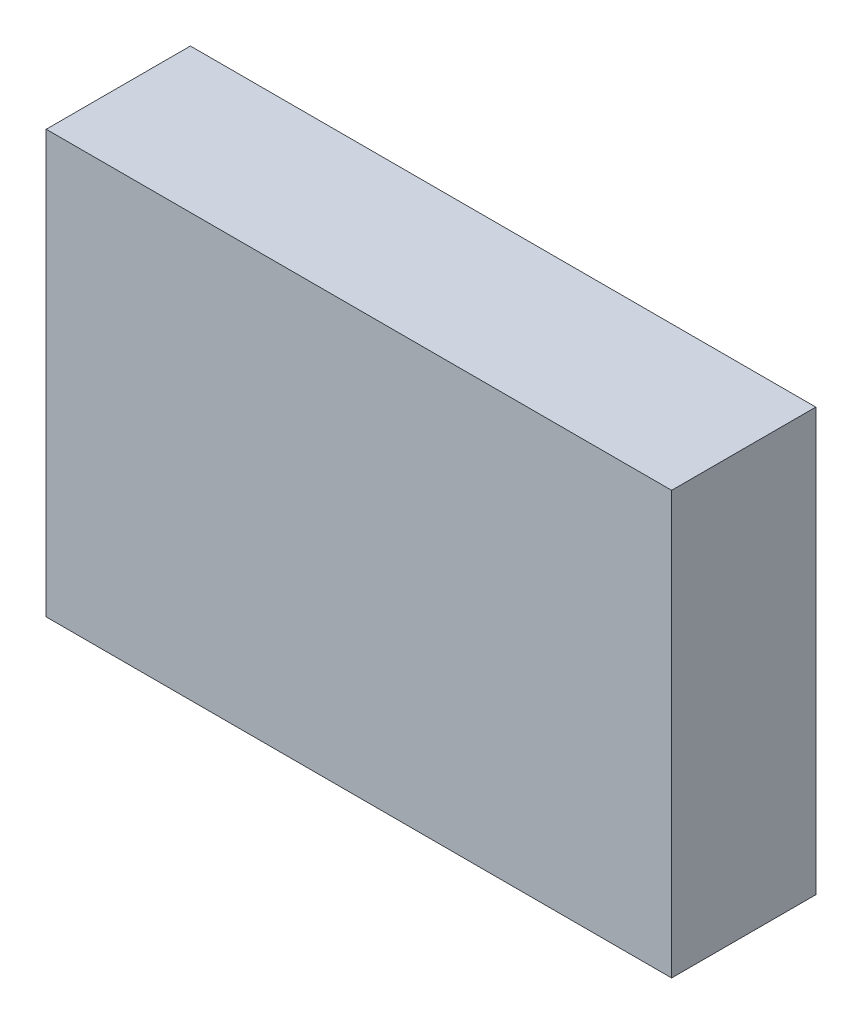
from build123d import *

# Parameters (mm, degrees)
SKICA1_W                                          = 150
SKICA1_H                                          = 100
VYSUNOUT1_DEPTH                                   = 30
ZKOSEN_2_SIZE                                     = 3
SKICA2_W                                          = 17.5
SKICA2_H                                          = 20
VYSUNOUT2_DEPTH                                   = 129.549601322
SKICA3_W                                          = 17.5
SKICA3_H                                          = 60
VYSUNOUT3_DEPTH                                   = 93.330926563
ZAOBLIT1_R                                        = 6
ZKOSEN_1_SIZE                                     = 3
V_LCOV_ZAHLOUBEN_PRO_M6_ROUBY_S_K_NIC_D           = 6.6
V_LCOV_ZAHLOUBEN_PRO_M6_ROUBY_S_K_NIC_CBORE_D     = 11
V_LCOV_ZAHLOUBEN_PRO_M6_ROUBY_S_K_NIC_CBORE_DEPTH = 3.9
ZKOSEN_4_SIZE                                     = 0.5
VYSUNOUT5_DEPTH                                   = 15
VYSUNOUT4_DEPTH                                   = 5
ZAOBLIT2_R                                        = 6
VYSUNOUT6_START                                   = -20
VYSUNOUT6_DEPTH                                   = 20
VYSUNOUT8_DEPTH                                   = 20
M4X0_7_Z_VIT1_D                                   = 3.3
M4X0_7_Z_VIT1_DEPTH                               = 11.5
M4X0_7_Z_VIT1_TIP                                 = 0.991420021
M4X0_7_Z_VIT1_ON_FACE_2_D                         = 3.3
M4X0_7_Z_VIT1_ON_FACE_2_DEPTH                     = 11.5
M4X0_7_Z_VIT1_ON_FACE_2_TIP                       = 0.991420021
VYSUNOUT9_DEPTH                                   = 94.541434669
ZAOBLIT5_R                                        = 3
VYSUNOUT11_REACH                                  = 123.514
SKICA15_R                                         = 5
VYSUNOUT12_DEPTH                                  = 3
F_5_0_5_PR_M_R_D_RY1_D                            = 5
F_5_0_5_PR_M_R_D_RY1_DEPTH                        = 10
F_5_0_5_PR_M_R_D_RY1_TIP                          = 1.502151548
ZKOSEN_3_SIZE                                     = 1
P_IDAT_VYSUNUT_M1_DEPTH                           = 30.5
P_IDAT_VYSUNUT_M1_DEPTH_BACK                      = 5
SKICA22_W                                         = 154
SKICA22_H                                         = 104


with BuildPart() as part:
    # Skica1 → Vysunout1 (new body)
    with BuildSketch(Plane.XY):
        Rectangle(SKICA1_W, SKICA1_H)
    extrude(amount=VYSUNOUT1_DEPTH)

    # Zkosen_2
    zkosen_2_edges = [part.edges().sort_by_distance(p)[0] for p in [
        (75, -50, 15),
        (-75, -50, 15),
        (-75, 50, 15),
        (75, 50, 15),
    ]]
    chamfer(zkosen_2_edges, length=ZKOSEN_2_SIZE)

    # Skica2 → Vysunout2 (cut, through all)
    with BuildSketch(Plane.XZ.offset(50)):
        with Locations((66.25, 20)):
            Rectangle(SKICA2_W, SKICA2_H)
        with Locations((-66.25, 20)):
            Rectangle(SKICA2_W, SKICA2_H)
    extrude(amount=-VYSUNOUT2_DEPTH, mode=Mode.SUBTRACT)

    # Skica3 → Vysunout3 (cut, through all)
    with BuildSketch(Plane.XY.offset(10)):
        with Locations((66.25, 0)):
            Rectangle(SKICA3_W, SKICA3_H)
        with Locations((-66.25, 0)):
            Rectangle(SKICA3_W, SKICA3_H)
    extrude(amount=-VYSUNOUT3_DEPTH, mode=Mode.SUBTRACT)

    # Zaoblit1
    zaoblit1_edges = [part.edges().sort_by_distance(p)[0] for p in [
        (-57.5, 30, 5),
        (-57.5, -30, 5),
        (57.5, -30, 5),
        (57.5, 30, 5),
    ]]
    fillet(zaoblit1_edges, radius=ZAOBLIT1_R)

    # Zkosen_1
    zkosen_1_edges = [part.edges().sort_by_distance(p)[0] for p in [
        (-75, 30, 5),
        (-75, -30, 5),
        (75, 30, 5),
        (75, -30, 5),
    ]]
    chamfer(zkosen_1_edges, length=ZKOSEN_1_SIZE)

    # V_lcov_ zahlouben_ pro M6 _rouby s k_nic (through all)
    with Locations(Plane.XY.offset(10)):
        with Locations((-66.25, 40), (-66.25, -40), (66.25, -40), (66.25, 40)):
            CounterBoreHole(V_LCOV_ZAHLOUBEN_PRO_M6_ROUBY_S_K_NIC_D / 2, V_LCOV_ZAHLOUBEN_PRO_M6_ROUBY_S_K_NIC_CBORE_D / 2, V_LCOV_ZAHLOUBEN_PRO_M6_ROUBY_S_K_NIC_CBORE_DEPTH)

    # Zkosen_4
    zkosen_4_edges = [part.edges().sort_by_distance(p)[0] for p in [
        (69.55, 40, 6.1),
        (69.55, -40, 6.1),
        (-62.95, -40, 6.1),
        (-62.95, 40, 6.1),
    ]]
    chamfer(zkosen_4_edges, length=ZKOSEN_4_SIZE)

    # Skica7 → Vysunout5 (cut, symmetric)
    with BuildSketch(Plane(origin=(0, 0, 0), x_dir=(1, 0, 0), z_dir=(0, 1, 0))):
        Polygon((57.5, -5), (32.5, -30), (57.5, -30), align=None)
    extrude(amount=VYSUNOUT5_DEPTH, both=True, mode=Mode.SUBTRACT)

    # Skica6 → Vysunout4 (cut)
    with BuildSketch(Plane.XY.offset(30)):
        with BuildLine():
            Line((-17.5, -45), (-17.5, -19.330127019))
            ThreePointArc((-17.5, -19.330127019), (-15, -10), (-12.5, -19.330127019))
            Line((-12.5, -19.330127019), (-12.5, -45))
            Line((-12.5, -45), (52.5, -45))
            Line((52.5, -45), (52.5, -20))
            Line((52.5, -20), (27.5, -20))
            Line((27.5, -20), (27.5, 20))
            Line((27.5, 20), (52.5, 20))
            Line((52.5, 20), (52.5, 45))
            Line((52.5, 45), (-12.5, 45))
            Line((-12.5, 45), (-12.5, 19.330127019))
            ThreePointArc((-12.5, 19.330127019), (-15, 10), (-17.5, 19.330127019))
            Line((-17.5, 19.330127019), (-17.5, 45))
            Line((-17.5, 45), (-52.5, 45))
            Line((-52.5, 45), (-52.5, -45))
            Line((-52.5, -45), (-17.5, -45))
        make_face()
    extrude(amount=-VYSUNOUT4_DEPTH, mode=Mode.SUBTRACT)

    # Zaoblit2
    zaoblit2_edges = [part.edges().sort_by_distance(p)[0] for p in [
        (-17.5, -19.330127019, 27.5),
        (-17.5, -45, 27.5),
        (-52.5, -45, 27.5),
        (-52.5, 45, 27.5),
        (-17.5, 45, 27.5),
        (-17.5, 19.330127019, 27.5),
        (-12.5, 19.330127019, 27.5),
        (-12.5, 45, 27.5),
        (52.5, 45, 27.5),
        (52.5, 20, 27.5),
        (52.5, -20, 27.5),
        (52.5, -45, 27.5),
        (-12.5, -45, 27.5),
        (-12.5, -19.330127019, 27.5),
    ]]
    fillet(zaoblit2_edges, radius=ZAOBLIT2_R)

    # Skica8 → Vysunout6 (cut)
    with BuildSketch(Plane.XY.offset(25).offset(VYSUNOUT6_START)):
        with BuildLine():
            Line((52.5, 26), (52.5, 39))
            ThreePointArc((52.5, 39), (50.742640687, 43.242640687), (46.5, 45))
            Line((46.5, 45), (-6.5, 45))
            ThreePointArc((-6.5, 45), (-10.742640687, 43.242640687), (-12.5, 39))
            Line((-12.5, 39), (-12.5, 26))
            ThreePointArc((-12.5, 26), (-10.742640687, 21.757359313), (-6.5, 20))
            Line((-6.5, 20), (46.5, 20))
            ThreePointArc((46.5, 20), (50.742640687, 21.757359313), (52.5, 26))
        make_face()
    extrude(amount=VYSUNOUT6_DEPTH, mode=Mode.SUBTRACT)

    # Skica9 → Vysunout8 (cut)
    with BuildSketch(Plane.XY.offset(25)):
        with BuildLine():
            Line((-50.5, -9), (-50.5, -39))
            ThreePointArc((-50.5, -39), (-49.328427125, -41.828427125), (-46.5, -43))
            Line((-46.5, -43), (-23.5, -43))
            ThreePointArc((-23.5, -43), (-20.671572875, -41.828427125), (-19.5, -39))
            Line((-19.5, -39), (-19.5, -21.982120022))
            ThreePointArc((-19.5, -21.982120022), (-19.734124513, -20.633720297), (-20.409090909, -19.443167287))
            ThreePointArc((-20.409090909, -19.443167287), (-15, -8), (-9.590909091, -19.443167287))
            ThreePointArc((-9.590909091, -19.443167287), (-10.265875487, -20.633720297), (-10.5, -21.982120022))
            Line((-10.5, -21.982120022), (-10.5, -39))
            ThreePointArc((-10.5, -39), (-9.328427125, -41.828427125), (-6.5, -43))
            Line((-6.5, -43), (46.5, -43))
            ThreePointArc((46.5, -43), (49.328427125, -41.828427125), (50.5, -39))
            Line((50.5, -39), (50.5, -26))
            ThreePointArc((50.5, -26), (49.328427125, -23.171572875), (46.5, -22))
            Line((46.5, -22), (25.5, -22))
            Line((25.5, -22), (25.5, 14))
            ThreePointArc((25.5, 14), (24.328427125, 16.828427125), (21.5, 18))
            Line((21.5, 18), (-4.04554885, 18))
            ThreePointArc((-4.04554885, 18), (-6.7423483, 16.954195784), (-8.028985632, 14.363636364))
            ThreePointArc((-8.028985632, 14.363636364), (-17.657124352, 8.523913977), (-20.409090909, 19.443167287))
            ThreePointArc((-20.409090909, 19.443167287), (-19.734124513, 20.633720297), (-19.5, 21.982120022))
            Line((-19.5, 21.982120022), (-19.5, 39))
            ThreePointArc((-19.5, 39), (-20.671572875, 41.828427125), (-23.5, 43))
            Line((-23.5, 43), (-46.5, 43))
            ThreePointArc((-46.5, 43), (-49.328427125, 41.828427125), (-50.5, 39))
            Line((-50.5, 39), (-50.5, 9))
            ThreePointArc((-50.5, 9), (-49.328427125, 6.171572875), (-46.5, 5))
            ThreePointArc((-46.5, 5), (-41.5, 0), (-46.5, -5))
            ThreePointArc((-46.5, -5), (-49.328427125, -6.171572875), (-50.5, -9))
        make_face()
    extrude(amount=-VYSUNOUT8_DEPTH, mode=Mode.SUBTRACT)

    # M4x0.7 z_vit1
    with Locations(Plane(origin=(-46.5, 0, 25), x_dir=(1, 0, 0), z_dir=(0, 0, 1))):
        with Locations((0, 0)):
            Hole(M4X0_7_Z_VIT1_D / 2, depth=M4X0_7_Z_VIT1_DEPTH)
            with Locations((0, 0, -(M4X0_7_Z_VIT1_DEPTH + M4X0_7_Z_VIT1_TIP / 2))):  # 118° drill point
                Cone(0, M4X0_7_Z_VIT1_D / 2, M4X0_7_Z_VIT1_TIP, mode=Mode.SUBTRACT)

    # M4x0.7 z_vit1 on face 2
    with Locations(Plane(origin=(-15, 15, 30), x_dir=(1, 0, 0), z_dir=(0, 0, 1))):
        with Locations((0, 0), (0, -30)):
            Hole(M4X0_7_Z_VIT1_ON_FACE_2_D / 2, depth=M4X0_7_Z_VIT1_ON_FACE_2_DEPTH)
            with Locations((0, 0, -(M4X0_7_Z_VIT1_ON_FACE_2_DEPTH + M4X0_7_Z_VIT1_ON_FACE_2_TIP / 2))):  # 118° drill point
                Cone(0, M4X0_7_Z_VIT1_ON_FACE_2_D / 2, M4X0_7_Z_VIT1_ON_FACE_2_TIP, mode=Mode.SUBTRACT)

    # Skica11 → Vysunout9 (cut, through all)
    with BuildSketch(Plane.XY.offset(5)):
        with BuildLine():
            Line((-22.5, 21.614378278), (-22.5, 40))
            Line((-22.5, 40), (-47.5, 40))
            Line((-47.5, 40), (-47.5, 7.937253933))
            ThreePointArc((-47.5, 7.937253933), (-43.076880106, 7.230646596), (-39.726869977, 4.257312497))
            ThreePointArc((-39.726869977, 4.257312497), (-33.492284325, 10.981515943), (-24.332396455, 11.407455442))
            ThreePointArc((-24.332396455, 11.407455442), (-24.842647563, 16.766999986), (-22.5, 21.614378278))
        make_face()
        with BuildLine():
            Line((-47.5, -7.937253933), (-47.5, -40))
            Line((-47.5, -40), (-22.5, -40))
            Line((-22.5, -40), (-22.5, -21.614378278))
            ThreePointArc((-22.5, -21.614378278), (-24.842647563, -16.766999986), (-24.332396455, -11.407455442))
            ThreePointArc((-24.332396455, -11.407455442), (-33.492284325, -10.981515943), (-39.726869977, -4.257312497))
            ThreePointArc((-39.726869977, -4.257312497), (-43.076880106, -7.230646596), (-47.5, -7.937253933))
        make_face()
        with BuildLine():
            Line((-7.5, -21.614378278), (-7.5, -40))
            Line((-7.5, -40), (47.5, -40))
            Line((47.5, -40), (47.5, -25))
            Line((47.5, -25), (22.5, -25))
            Line((22.5, -25), (22.5, 15))
            Line((22.5, 15), (-5, 15))
            ThreePointArc((-5, 15), (-8.882691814, 7.089340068), (-17.515708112, 5.321611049))
            ThreePointArc((-17.515708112, 5.321611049), (-16.28358209, 0), (-17.515708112, -5.321611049))
            ThreePointArc((-17.515708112, -5.321611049), (-6.480941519, -9.763050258), (-7.5, -21.614378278))
        make_face()
    extrude(amount=-VYSUNOUT9_DEPTH, mode=Mode.SUBTRACT)

    # Zaoblit5
    zaoblit5_edges = [part.edges().sort_by_distance(p)[0] for p in [
        (-17.515708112, -5.321611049, 2.5),
        (-17.515708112, 5.321611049, 2.5),
        (-5, 15, 2.5),
        (22.5, 15, 2.5),
        (22.5, -25, 2.5),
        (47.5, -25, 2.5),
        (47.5, -40, 2.5),
        (-7.5, -40, 2.5),
        (-7.5, -21.614378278, 2.5),
        (-24.332396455, 11.407455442, 2.5),
        (-39.726869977, 4.257312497, 2.5),
        (-47.5, 7.937253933, 2.5),
        (-47.5, 40, 2.5),
        (-22.5, 40, 2.5),
        (-22.5, 21.614378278, 2.5),
        (-47.5, -7.937253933, 2.5),
        (-39.726869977, -4.257312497, 2.5),
        (-24.332396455, -11.407455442, 2.5),
        (-22.5, -21.614378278, 2.5),
        (-22.5, -40, 2.5),
        (-47.5, -40, 2.5),
    ]]
    fillet(zaoblit5_edges, radius=ZAOBLIT5_R)

    # Vysunout11: up to this plane
    vysunout11_end = Plane(origin=(25.5, -22, -127.653684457), z_dir=(1, 0, 0))
    # Skica15 → Vysunout11 (cut, up to the surface)
    with BuildSketch(Plane(origin=(31.25, 0, 31.25), x_dir=(0.7071067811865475, 0, -0.7071067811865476), z_dir=(0.7071067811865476, 0, 0.7071067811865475)), mode=Mode.PRIVATE) as vysunout11_sk1:
        with Locations((8.838834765, 0)):
            Circle(SKICA15_R)
    vysunout11_tool1 = split(extrude(vysunout11_sk1.sketch, amount=-VYSUNOUT11_REACH, mode=Mode.PRIVATE), bisect_by=vysunout11_end, keep=Keep.BOTH, mode=Mode.PRIVATE)
    add(vysunout11_tool1.solids().sort_by_distance((37.5, 0, 25))[0], mode=Mode.SUBTRACT)

    # Skica16 → Vysunout12 (cut)
    with BuildSketch(Plane(origin=(31.25, 0, 31.25), x_dir=(0.7071067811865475, 0, -0.7071067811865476), z_dir=(0.7071067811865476, 0, 0.7071067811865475))):
        with BuildLine():
            Line((8.838834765, 6), (23.838834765, 6))
            ThreePointArc((23.838834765, 6), (29.838834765, 0), (23.838834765, -6))
            Line((23.838834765, -6), (8.838834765, -6))
            ThreePointArc((8.838834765, -6), (2.838834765, 0), (8.838834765, 6))
        make_face()
    extrude(amount=-VYSUNOUT12_DEPTH, mode=Mode.SUBTRACT)

    # 5.0 _5_ pr_m_r d_ry1
    with Locations(Plane(origin=(29.128679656, 0, 29.128679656), x_dir=(0.7071067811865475, 0, -0.7071067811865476), z_dir=(0.7071067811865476, 0, 0.7071067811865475))):
        with Locations((23.838834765, 0)):
            Hole(F_5_0_5_PR_M_R_D_RY1_D / 2, depth=F_5_0_5_PR_M_R_D_RY1_DEPTH)
            with Locations((0, 0, -(F_5_0_5_PR_M_R_D_RY1_DEPTH + F_5_0_5_PR_M_R_D_RY1_TIP / 2))):  # 118° drill point
                Cone(0, F_5_0_5_PR_M_R_D_RY1_D / 2, F_5_0_5_PR_M_R_D_RY1_TIP, mode=Mode.SUBTRACT)

    # Zkosen_3
    zkosen_3_edges = [part.edges().sort_by_distance(p)[0] for p in [
        (27.5, 0, 30),
        (37, -20, 30),
        (52.5, -32.5, 30),
        (52.5, 32.5, 30),
        (37, 20, 30),
        (20, 45, 30),
        (-12.5, 30.491060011, 30),
        (-15, 10, 30),
        (-17.5, 30.491060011, 30),
        (-35, 45, 30),
        (-35, -45, 30),
        (-52.5, 0, 30),
        (-17.5, -30.491060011, 30),
        (-15, -10, 30),
        (-12.5, -30.491060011, 30),
        (20, -45, 30),
        (50.742640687, -21.757359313, 30),
        (50.742640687, 21.757359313, 30),
        (50.742640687, 43.242640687, 30),
        (-10.742640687, 43.242640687, 30),
        (-12.14881323, 19.959520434, 30),
        (-17.85118677, 19.959520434, 30),
        (-19.257359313, 43.242640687, 30),
        (-50.742640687, -43.242640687, 30),
        (-19.257359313, -43.242640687, 30),
        (-17.85118677, -19.959520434, 30),
        (-12.14881323, -19.959520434, 30),
        (-10.742640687, -43.242640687, 30),
        (50.742640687, -43.242640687, 30),
        (-50.742640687, 43.242640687, 30),
    ]]
    chamfer(zkosen_3_edges, length=ZKOSEN_3_SIZE)


with BuildPart() as body_2:
    # Skica22 → P_idat vysunut_m1 (new, two sides: drawn at the far end of the back side and taken through both)
    with BuildSketch(Plane.XY.offset(-P_IDAT_VYSUNUT_M1_DEPTH_BACK)):
        Rectangle(SKICA22_W, SKICA22_H)
    extrude(amount=P_IDAT_VYSUNUT_M1_DEPTH + P_IDAT_VYSUNUT_M1_DEPTH_BACK)


solid = Compound([part.part, body_2.part])
